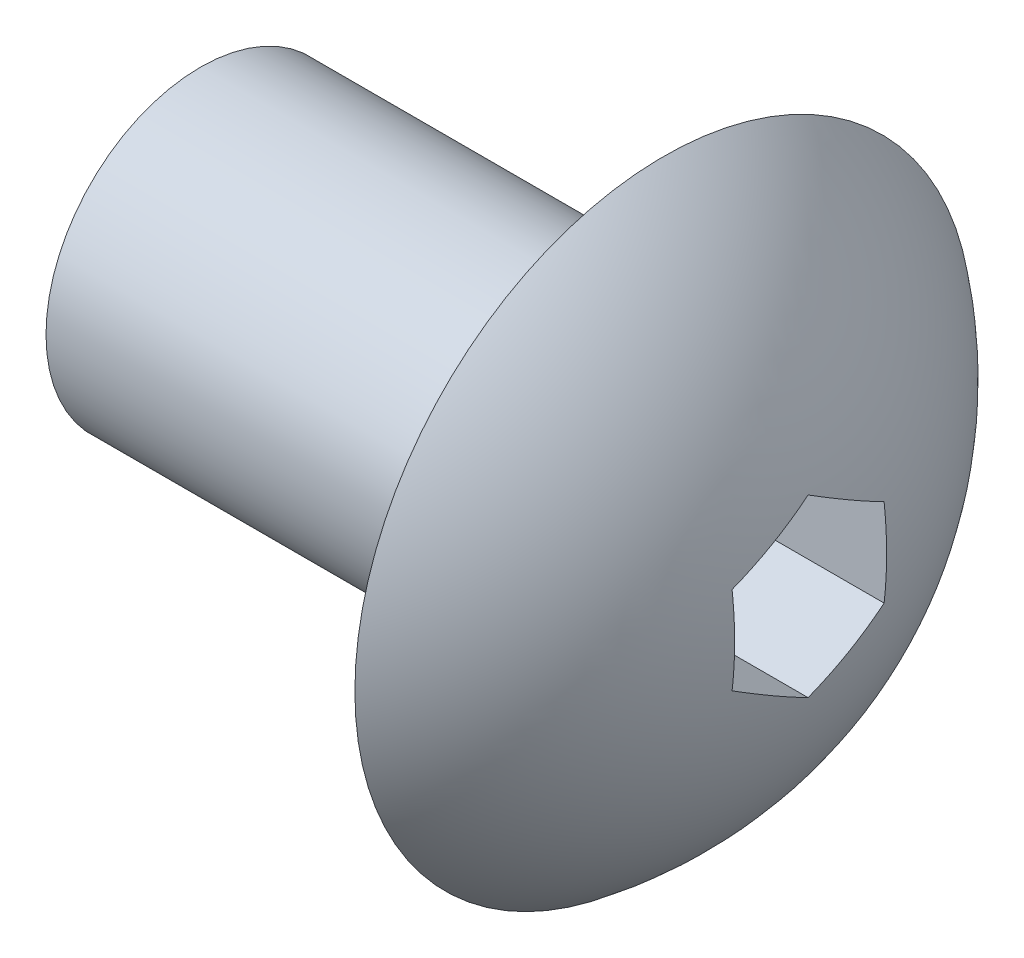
from build123d import *

# Parameters (mm, degrees)
CUT_EXTRUDE1_DEPTH = 3.81


with BuildPart() as part:
    # Sketch1 → Revolve1 (revolve)
    with BuildSketch(Plane(origin=(0, 0, 0), x_dir=(1, 0, 0), z_dir=(0, 1, 0))):
        with BuildLine():
            Line((0, 0), (0, -2.54))
            Line((0, -2.54), (7.62, -2.54))
            Line((7.62, -2.54), (7.62, -5.08))
            ThreePointArc((7.62, -5.08), (9.489612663, -2.839806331), (10.16, 0))
            Line((10.16, 0), (0, 0))
        make_face()
    revolve(axis=Axis((0, 0, 0), (1, 0, 0)))

    # Sketch2 → Cut-Extrude1 (cut)
    with BuildSketch(Plane(origin=(10.16, 0, 0), x_dir=(0, 0, -1), z_dir=(1, 0, 0))):
        Polygon((0, -1.443375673), (1.25, -0.721687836), (1.25, 0.721687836), (0, 1.443375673), (-1.25, 0.721687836), (-1.25, -0.721687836), align=None)
    extrude(amount=-CUT_EXTRUDE1_DEPTH, mode=Mode.SUBTRACT)


solid = part.part
